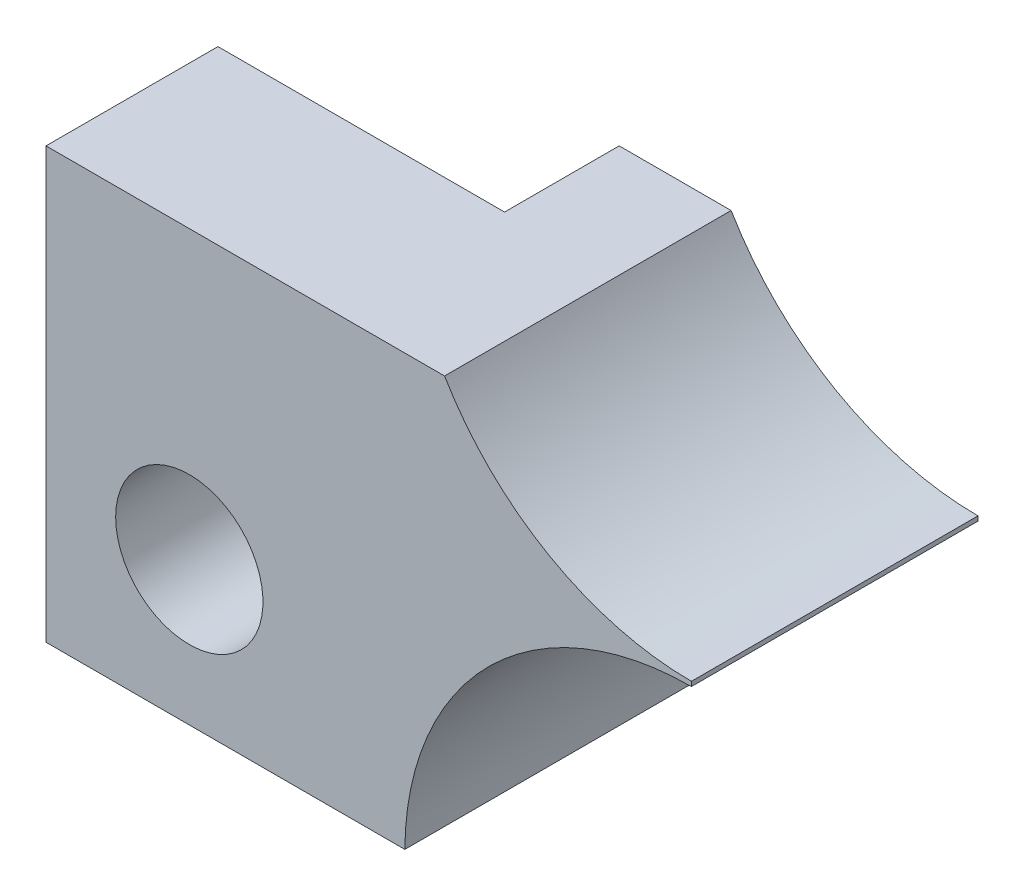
from build123d import *

# Parameters (mm, degrees)
SKETCH1_R            = 1.63195
EXTRUDE1_DEPTH       = 6.35
SKETCH2_W            = 6.35
SKETCH2_H            = 2.54
CUT_EXTRUDE1_DEPTH   = 116.178567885
CUT_EXTRUDE2_DEPTH   = 115.871833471
CUT_EXTRUDE3_DEPTH   = 115.871833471
SKETCH5_R            = 1.63195
CUT_EXTRUDE4_DEPTH   = 116.178567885
EXTRUDE10_DEPTH      = 2.54
EXTRUDE10_DEPTH_BACK = 116.178567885
SKETCH7_W            = 101.6
SKETCH7_H            = 25.4


with BuildPart() as part:
    # Sketch1 → Extrude1 (new body)
    with BuildSketch(Plane.XY):
        with BuildLine():
            Line((0, 9.525), (0, 0))
            Line((0, 0), (7.950403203, 0))
            ThreePointArc((7.950403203, 0), (12.65282779, 6.081790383), (19.769817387, 3.175))
            Line((19.769817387, 3.175), (91.355182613, 3.175))
            ThreePointArc((91.355182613, 3.175), (96.8248, 6.2992), (102.294417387, 3.175))
            Line((102.294417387, 3.175), (114.3, 3.175))
            Line((114.3, 3.175), (114.3, 12.7))
            Line((114.3, 12.7), (103.174596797, 12.7))
            ThreePointArc((103.174596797, 12.7), (98.47217221, 6.618209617), (91.355182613, 9.525))
            Line((91.355182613, 9.525), (19.769817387, 9.525))
            ThreePointArc((19.769817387, 9.525), (14.3002, 6.4008), (8.830582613, 9.525))
            Line((8.830582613, 9.525), (0, 9.525))
        make_face()
        with BuildLine():
            Line((109.22, 11.15695), (111.76, 11.15695))
            ThreePointArc((111.76, 11.15695), (113.39195, 9.525), (111.76, 7.89305))
            Line((111.76, 7.89305), (109.22, 7.89305))
            ThreePointArc((109.22, 7.89305), (107.58805, 9.525), (109.22, 11.15695))
        make_face(mode=Mode.SUBTRACT)
        with Locations(Location((3.175, 3.175, 0), (0, 0, 180))):
            Circle(SKETCH1_R, mode=Mode.SUBTRACT)
    extrude(amount=EXTRUDE1_DEPTH)

    # Sketch2 → Cut-Extrude1 (cut, through all)
    with BuildSketch(Plane.XZ):
        with Locations((3.175, 1.27)):
            Rectangle(SKETCH2_W, SKETCH2_H)
    extrude(amount=-CUT_EXTRUDE1_DEPTH, mode=Mode.SUBTRACT)

    # Sketch3 → Cut-Extrude2 (cut, through all)
    with BuildSketch(Plane.XZ.offset(-3.175)):
        with BuildLine():
            Line((104.775, 0), (114.3, 0))
            Line((114.3, 0), (114.3, 2.54))
            Line((114.3, 2.54), (107.2896, 2.54))
            ThreePointArc((107.2896, 2.54), (105.511509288, 1.803490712), (104.775, 0.0254))
            Line((104.775, 0.0254), (104.775, 0))
        make_face()
    extrude(amount=-CUT_EXTRUDE2_DEPTH, mode=Mode.SUBTRACT)

    # Sketch4 → Cut-Extrude3 (cut, through all)
    with BuildSketch(Plane(origin=(0, 9.525, 0), x_dir=(1, 0, 0), z_dir=(0, 1, 0))):
        with BuildLine():
            ThreePointArc((25.4, -2.794), (25.848403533, -1.167255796), (27.066958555, 0))
            Line((27.066958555, 0), (25.4, 0))
            Line((25.4, 0), (25.4, -2.794))
        make_face()
        with BuildLine():
            Line((31.75, -2.794), (31.75, 0))
            Line((31.75, 0), (30.083041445, 0))
            ThreePointArc((30.083041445, 0), (31.301596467, -1.167255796), (31.75, -2.794))
        make_face()
        with BuildLine():
            ThreePointArc((31.75, -2.794), (31.301596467, -1.167255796), (30.083041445, 0))
            Line((30.083041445, 0), (27.066958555, 0))
            ThreePointArc((27.066958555, 0), (25.848403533, -1.167255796), (25.4, -2.794))
            Line((25.4, -2.794), (31.75, -2.794))
        make_face()
        with BuildLine():
            ThreePointArc((25.4, -2.794), (28.575, -5.969), (31.75, -2.794))
            Line((31.75, -2.794), (25.4, -2.794))
        make_face()
        with BuildLine():
            Line((79.375, 0), (79.375, -2.794))
            ThreePointArc((79.375, -2.794), (79.823403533, -1.167255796), (81.041958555, 0))
            Line((81.041958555, 0), (79.375, 0))
        make_face()
        with BuildLine():
            Line((79.375, -2.794), (85.725, -2.794))
            ThreePointArc((85.725, -2.794), (85.276596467, -1.167255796), (84.058041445, 0))
            Line((84.058041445, 0), (81.041958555, 0))
            ThreePointArc((81.041958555, 0), (79.823403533, -1.167255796), (79.375, -2.794))
        make_face()
        with BuildLine():
            ThreePointArc((84.058041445, 0), (85.276596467, -1.167255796), (85.725, -2.794))
            Line((85.725, -2.794), (85.725, 0))
            Line((85.725, 0), (84.058041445, 0))
        make_face()
        with BuildLine():
            ThreePointArc((79.375, -2.794), (82.55, -5.969), (85.725, -2.794))
            Line((85.725, -2.794), (79.375, -2.794))
        make_face()
    extrude(amount=-CUT_EXTRUDE3_DEPTH, mode=Mode.SUBTRACT)

    # Sketch5 → Cut-Extrude4 (cut, through all)
    with BuildSketch(Plane(origin=(0, 0, 0), x_dir=(-1, 0, 0), z_dir=(0, 0, -1))):
        with Locations((-74.93, 6.35)):
            Circle(SKETCH5_R)
        with Locations((-39.37, 6.35)):
            Circle(SKETCH5_R)
    extrude(amount=-CUT_EXTRUDE4_DEPTH, mode=Mode.SUBTRACT)

    # Sketch7 → Extrude10 (cut, two sides: drawn at the far end of the back side and taken through both)
    with BuildSketch(Plane(origin=(0, 0, 0), x_dir=(-1, 0, 0), z_dir=(0, 0, -1)).offset(-EXTRUDE10_DEPTH_BACK)):
        with Locations((-65.1002, 12.6492)):
            Rectangle(SKETCH7_W, SKETCH7_H)
    extrude(amount=EXTRUDE10_DEPTH + EXTRUDE10_DEPTH_BACK, mode=Mode.SUBTRACT)


solid = part.part
